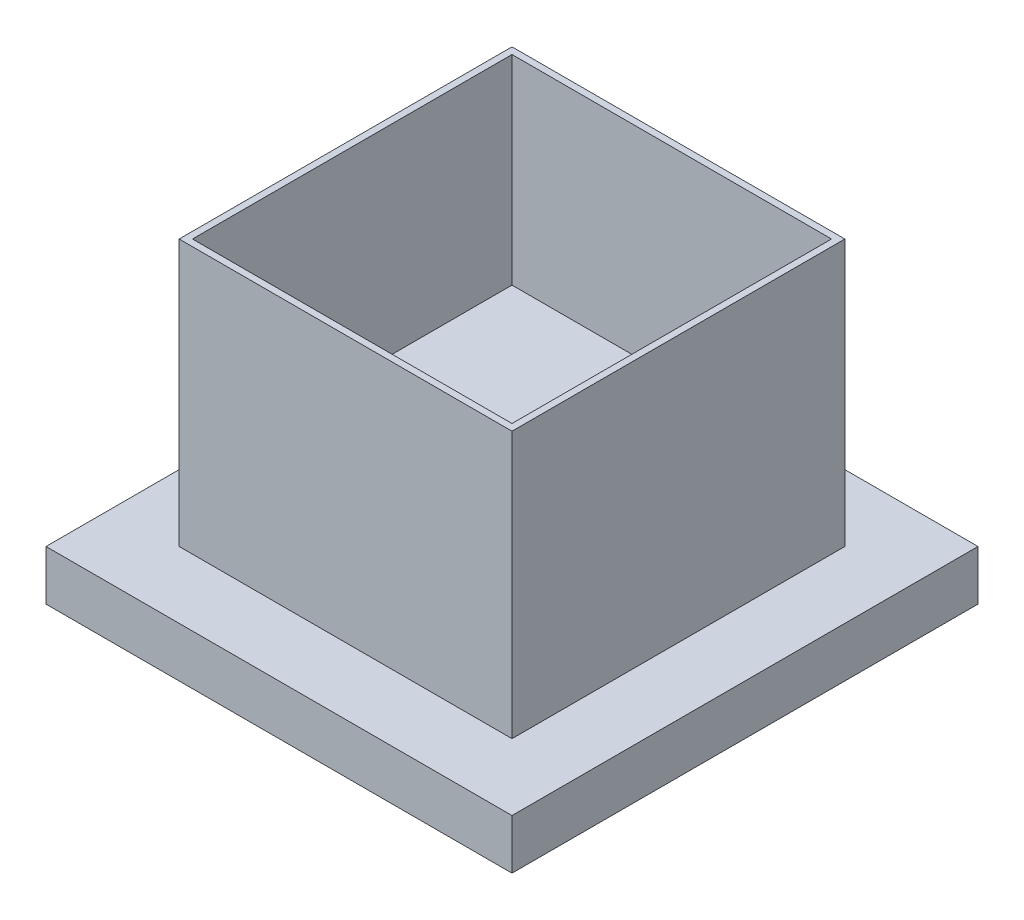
from build123d import *

# Parameters (mm, degrees)
CROQUIS1_W              = 70
CROQUIS1_H              = 70
SALIENTE_EXTRUIR1_DEPTH = 7.5
CROQUIS2_W              = 50
CROQUIS2_H              = 50
SALIENTE_EXTRUIR2_DEPTH = 40
CROQUIS3_W              = 48
CROQUIS3_H              = 48
CORTAR_EXTRUIR1_DEPTH   = 30
SALIENTE_EXTRUIR3_REACH = 105.449
CROQUIS7_W              = 24.322973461
CROQUIS7_H              = 16.032476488
CROQUIS9_W              = 14.825680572
CROQUIS9_H              = 13.610298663
CORTAR_EXTRUIR2_DEPTH   = 98.267333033


with BuildPart() as part:
    # Croquis1 → Saliente-Extruir1 (new body)
    with BuildSketch(Plane(origin=(0, 0, 0), x_dir=(1, 0, 0), z_dir=(0, 1, 0))):
        with Locations((35, 35)):
            Rectangle(CROQUIS1_W, CROQUIS1_H)
    extrude(amount=SALIENTE_EXTRUIR1_DEPTH)

    # Croquis2 → Saliente-Extruir2 (add)
    with BuildSketch(Plane(origin=(0, 7.5, 0), x_dir=(1, 0, 0), z_dir=(0, 1, 0))):
        with Locations((35, 35)):
            Rectangle(CROQUIS2_W, CROQUIS2_H)
    extrude(amount=SALIENTE_EXTRUIR2_DEPTH)

    # Croquis3 → Cortar-Extruir1 (cut)
    with BuildSketch(Plane(origin=(0, 47.5, 0), x_dir=(1, 0, 0), z_dir=(0, 1, 0))):
        with Locations((35, 35)):
            Rectangle(CROQUIS3_W, CROQUIS3_H)
    extrude(amount=-CORTAR_EXTRUIR1_DEPTH, mode=Mode.SUBTRACT)

    # Croquis5 → Cortar-Revoluci_n1 (revolve, cut)
    with BuildSketch(Plane.XZ):
        with BuildLine():
            Line((34.6875, -30.36725405), (34.6875, -64.63274595))
            ThreePointArc((34.6875, -64.63274595), (34.098197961, -64.543955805), (33.561220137, -64.285469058))
            ThreePointArc((33.561220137, -64.285469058), (24.6875, -47.5), (33.561220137, -30.714530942))
            ThreePointArc((33.561220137, -30.714530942), (34.098197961, -30.456044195), (34.6875, -30.36725405))
        make_face()
    revolve(axis=Axis((34.6875, 0, -65), (0, 0, 1)), mode=Mode.SUBTRACT)

    # Croquis7 → Saliente-Extruir3 (add, up to next)
    with BuildSketch(Plane(origin=(0, -17.320508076, -30), x_dir=(-1, 0, 0), z_dir=(0, -0.500000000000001, -0.866025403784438)), mode=Mode.PRIVATE) as saliente_extruir3_sk1:
        with Locations((-34.154361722, 23.199865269)):
            Rectangle(CROQUIS7_W, CROQUIS7_H)
    saliente_extruir3_tool1 = extrude(saliente_extruir3_sk1.sketch, amount=-SALIENTE_EXTRUIR3_REACH, mode=Mode.PRIVATE) - part.part
    add(saliente_extruir3_tool1.solids().sort_by_distance((34.154362, 2.771165, -41.599933))[0])

    # Croquis9 → Cortar-Extruir2 (cut, through all)
    with BuildSketch(Plane.ZY.offset(-21.992874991)):
        with Locations((-34.750828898, -6.805149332)):
            Rectangle(CROQUIS9_W, CROQUIS9_H)
    extrude(amount=-CORTAR_EXTRUIR2_DEPTH, mode=Mode.SUBTRACT)


solid = part.part
